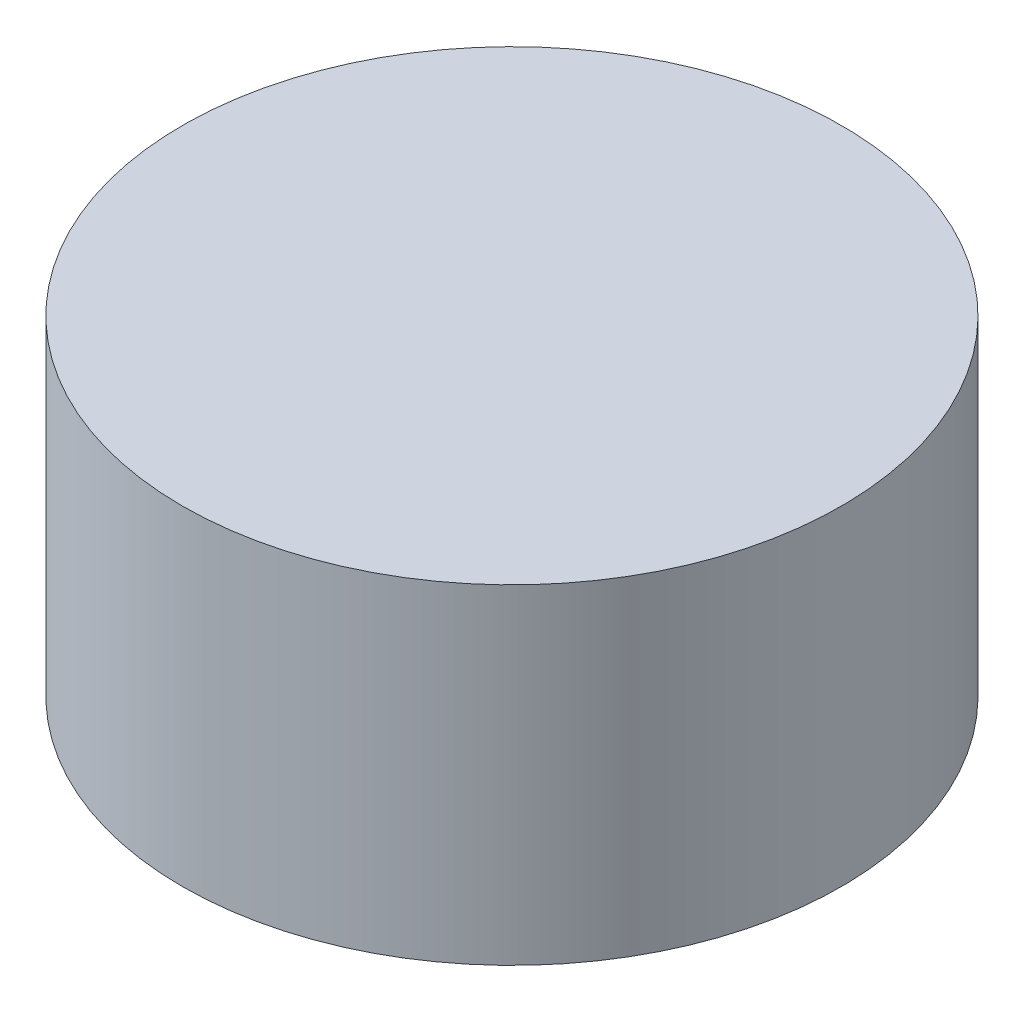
ISO-10303-21;
HEADER;
FILE_DESCRIPTION(('STEP AP214'),'2;1');
FILE_NAME('part.step','',(''),(''),'','','');
FILE_SCHEMA(('AUTOMOTIVE_DESIGN { 1 0 10303 214 1 1 1 1 }'));
ENDSEC;
DATA;
#1=APPLICATION_CONTEXT('core data for automotive mechanical design processes');
#2=APPLICATION_PROTOCOL_DEFINITION('international standard','automotive_design',2000,#1);
#3=PRODUCT_CONTEXT('',#1,'mechanical');
#4=PRODUCT('Part','Part','',(#3));
#5=PRODUCT_RELATED_PRODUCT_CATEGORY('part','',(#4));
#6=PRODUCT_DEFINITION_FORMATION('','',#4);
#7=PRODUCT_DEFINITION_CONTEXT('part definition',#1,'design');
#8=PRODUCT_DEFINITION('design','',#6,#7);
#9=PRODUCT_DEFINITION_SHAPE('','',#8);
#10=(LENGTH_UNIT() NAMED_UNIT(*) SI_UNIT(.MILLI.,.METRE.));
#11=(NAMED_UNIT(*) PLANE_ANGLE_UNIT() SI_UNIT($,.RADIAN.));
#12=(NAMED_UNIT(*) SI_UNIT($,.STERADIAN.) SOLID_ANGLE_UNIT());
#13=UNCERTAINTY_MEASURE_WITH_UNIT(LENGTH_MEASURE(1.E-05),#10,'distance_accuracy_value','');
#14=(GEOMETRIC_REPRESENTATION_CONTEXT(3) GLOBAL_UNCERTAINTY_ASSIGNED_CONTEXT((#13)) GLOBAL_UNIT_ASSIGNED_CONTEXT((#10,
#11,#12)) REPRESENTATION_CONTEXT('',''));
#15=CARTESIAN_POINT('',(0.,0.,0.));
#16=DIRECTION('',(0.,0.,1.));
#17=DIRECTION('',(1.,0.,0.));
#18=AXIS2_PLACEMENT_3D('',#15,#16,#17);
#19=CARTESIAN_POINT('',(4.8278025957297,-10.,0.));
#20=DIRECTION('',(0.,1.,0.));
#21=DIRECTION('',(0.,0.,1.));
#22=AXIS2_PLACEMENT_3D('',#19,#20,#21);
#23=CYLINDRICAL_SURFACE('',#22,20.);
#24=CARTESIAN_POINT('',(4.8278025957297,0.,0.));
#25=DIRECTION('',(0.,1.,0.));
#26=DIRECTION('',(0.,0.,1.));
#27=AXIS2_PLACEMENT_3D('',#24,#25,#26);
#28=CIRCLE('',#27,20.);
#29=CARTESIAN_POINT('',(4.8278025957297,0.,20.));
#30=VERTEX_POINT('',#29);
#31=EDGE_CURVE('E70',#30,#30,#28,.F.);
#32=ORIENTED_EDGE('',*,*,#31,.F.);
#33=EDGE_LOOP('',(#32));
#34=FACE_BOUND('',#33,.T.);
#35=CARTESIAN_POINT('',(4.8278025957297,20.,0.));
#36=DIRECTION('',(0.,1.,0.));
#37=DIRECTION('',(0.,0.,1.));
#38=AXIS2_PLACEMENT_3D('',#35,#36,#37);
#39=CIRCLE('',#38,20.);
#40=CARTESIAN_POINT('',(4.8278025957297,20.,20.));
#41=VERTEX_POINT('',#40);
#42=EDGE_CURVE('E105',#41,#41,#39,.T.);
#43=ORIENTED_EDGE('',*,*,#42,.F.);
#44=EDGE_LOOP('',(#43));
#45=FACE_BOUND('',#44,.T.);
#46=ADVANCED_FACE('F67',(#34,#45),#23,.T.);
#47=CARTESIAN_POINT('',(4.8278025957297,20.,0.));
#48=DIRECTION('',(0.,1.,0.));
#49=DIRECTION('',(0.,0.,1.));
#50=AXIS2_PLACEMENT_3D('',#47,#48,#49);
#51=PLANE('',#50);
#52=ORIENTED_EDGE('',*,*,#42,.T.);
#53=EDGE_LOOP('',(#52));
#54=FACE_BOUND('',#53,.T.);
#55=ADVANCED_FACE('F94',(#54),#51,.T.);
#56=CARTESIAN_POINT('',(4.8278025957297,-0.450000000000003,0.));
#57=DIRECTION('',(0.,-1.,0.));
#58=DIRECTION('',(1.,0.,0.));
#59=AXIS2_PLACEMENT_3D('',#56,#57,#58);
#60=SPHERICAL_SURFACE('',#59,13.45);
#61=CARTESIAN_POINT('',(4.8278025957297,3.,0.));
#62=DIRECTION('',(0.,-1.,0.));
#63=DIRECTION('',(0.,0.,-1.));
#64=AXIS2_PLACEMENT_3D('',#61,#62,#63);
#65=CIRCLE('',#64,13.);
#66=CARTESIAN_POINT('',(4.8278025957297,3.,-13.));
#67=VERTEX_POINT('',#66);
#68=EDGE_CURVE('E106',#67,#67,#65,.T.);
#69=ORIENTED_EDGE('',*,*,#68,.T.);
#70=EDGE_LOOP('',(#69));
#71=FACE_BOUND('',#70,.T.);
#72=ADVANCED_FACE('F99',(#71),#60,.F.);
#73=CARTESIAN_POINT('',(18.8278025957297,3.,0.));
#74=DIRECTION('',(0.,1.,0.));
#75=DIRECTION('',(0.,0.,1.));
#76=AXIS2_PLACEMENT_3D('',#73,#74,#75);
#77=PLANE('',#76);
#78=ORIENTED_EDGE('',*,*,#68,.F.);
#79=EDGE_LOOP('',(#78));
#80=FACE_BOUND('',#79,.T.);
#81=CARTESIAN_POINT('',(4.8278025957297,3.,0.));
#82=DIRECTION('',(0.,-1.,0.));
#83=DIRECTION('',(0.,0.,-1.));
#84=AXIS2_PLACEMENT_3D('',#81,#82,#83);
#85=CIRCLE('',#84,14.);
#86=CARTESIAN_POINT('',(4.8278025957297,3.,-14.));
#87=VERTEX_POINT('',#86);
#88=EDGE_CURVE('E75',#87,#87,#85,.T.);
#89=ORIENTED_EDGE('',*,*,#88,.T.);
#90=EDGE_LOOP('',(#89));
#91=FACE_BOUND('',#90,.T.);
#92=ADVANCED_FACE('F88',(#80,#91),#77,.F.);
#93=CARTESIAN_POINT('',(4.8278025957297,0.,0.));
#94=DIRECTION('',(0.,-1.,0.));
#95=DIRECTION('',(0.,0.,-1.));
#96=AXIS2_PLACEMENT_3D('',#93,#94,#95);
#97=CONICAL_SURFACE('',#96,15.,0.321750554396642);
#98=ORIENTED_EDGE('',*,*,#88,.F.);
#99=EDGE_LOOP('',(#98));
#100=FACE_BOUND('',#99,.T.);
#101=CARTESIAN_POINT('',(4.8278025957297,0.,0.));
#102=DIRECTION('',(0.,-1.,0.));
#103=DIRECTION('',(0.,0.,-1.));
#104=AXIS2_PLACEMENT_3D('',#101,#102,#103);
#105=CIRCLE('',#104,15.);
#106=CARTESIAN_POINT('',(4.8278025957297,0.,-15.));
#107=VERTEX_POINT('',#106);
#108=EDGE_CURVE('E13',#107,#107,#105,.T.);
#109=ORIENTED_EDGE('',*,*,#108,.T.);
#110=EDGE_LOOP('',(#109));
#111=FACE_BOUND('',#110,.T.);
#112=ADVANCED_FACE('F79',(#100,#111),#97,.F.);
#113=CARTESIAN_POINT('',(4.51562772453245,0.,-15.0000002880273));
#114=DIRECTION('',(0.,1.,0.));
#115=DIRECTION('',(0.999999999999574,0.,9.22647382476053E-07));
#116=AXIS2_PLACEMENT_3D('',#113,#114,#115);
#117=PLANE('',#116);
#118=ORIENTED_EDGE('',*,*,#31,.T.);
#119=EDGE_LOOP('',(#118));
#120=FACE_BOUND('',#119,.T.);
#121=ORIENTED_EDGE('',*,*,#108,.F.);
#122=EDGE_LOOP('',(#121));
#123=FACE_BOUND('',#122,.T.);
#124=ADVANCED_FACE('F81',(#120,#123),#117,.F.);
#125=CLOSED_SHELL('',(#46,#55,#72,#92,#112,#124));
#126=MANIFOLD_SOLID_BREP('B2',#125);
#127=ADVANCED_BREP_SHAPE_REPRESENTATION('',(#18,#126),#14);
#128=SHAPE_DEFINITION_REPRESENTATION(#9,#127);
ENDSEC;
END-ISO-10303-21;
